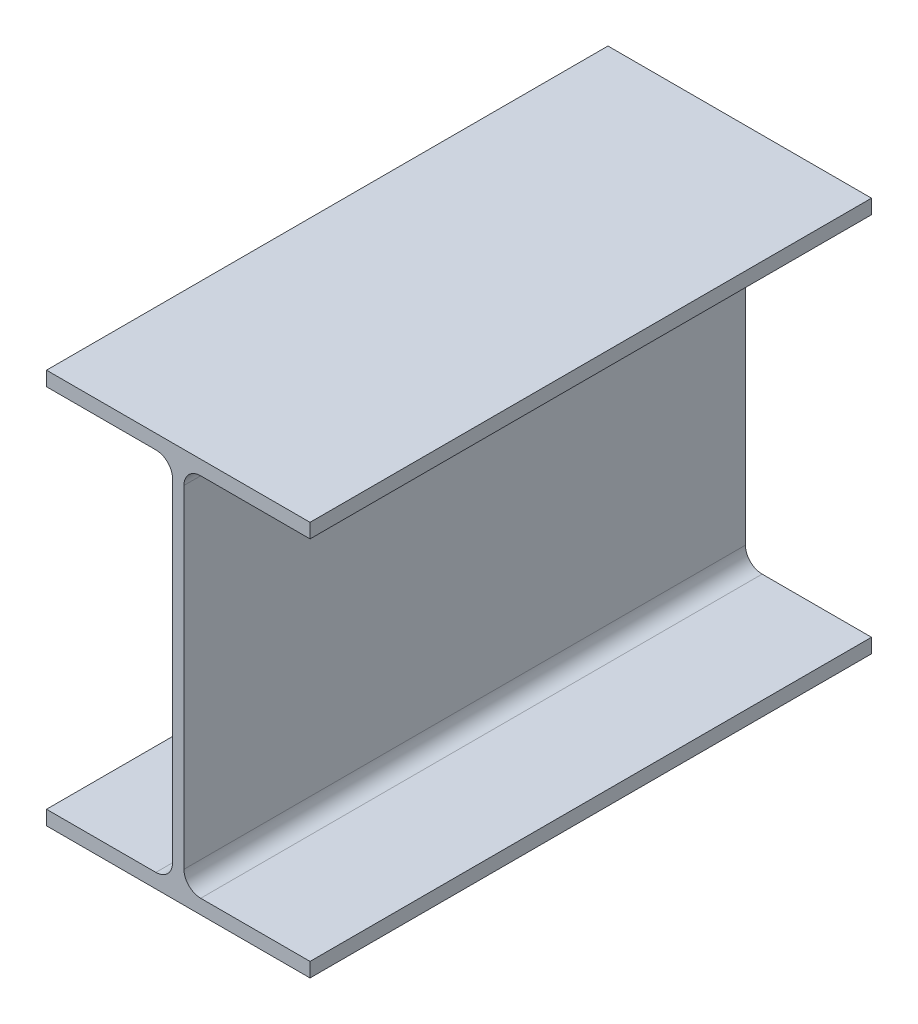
from build123d import *

# Parameters (mm, degrees)
BOSS_EXTRUDE1_DEPTH = 213.205063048


with BuildPart() as part:
    # sk W6x9 → Boss-Extrude1 (new body)
    with BuildSketch(Plane.XY):
        with BuildLine():
            Line((-50.038, -74.93), (-50.038, -69.469))
            Line((-50.038, -69.469), (-8.509, -69.469))
            ThreePointArc((-8.509, -69.469), (-4.018871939, -67.609128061), (-2.159, -63.119))
            Line((-2.159, -63.119), (-2.159, 63.119))
            ThreePointArc((-2.159, 63.119), (-4.018871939, 67.609128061), (-8.509, 69.469))
            Line((-8.509, 69.469), (-50.038, 69.469))
            Line((-50.038, 69.469), (-50.038, 74.93))
            Line((-50.038, 74.93), (50.038, 74.93))
            Line((50.038, 74.93), (50.038, 69.469))
            Line((50.038, 69.469), (8.509, 69.469))
            ThreePointArc((8.509, 69.469), (4.018871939, 67.609128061), (2.159, 63.119))
            Line((2.159, 63.119), (2.159, -63.119))
            ThreePointArc((2.159, -63.119), (4.018871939, -67.609128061), (8.509, -69.469))
            Line((8.509, -69.469), (50.038, -69.469))
            Line((50.038, -69.469), (50.038, -74.93))
            Line((50.038, -74.93), (-50.038, -74.93))
        make_face()
    extrude(amount=BOSS_EXTRUDE1_DEPTH)


solid = part.part
